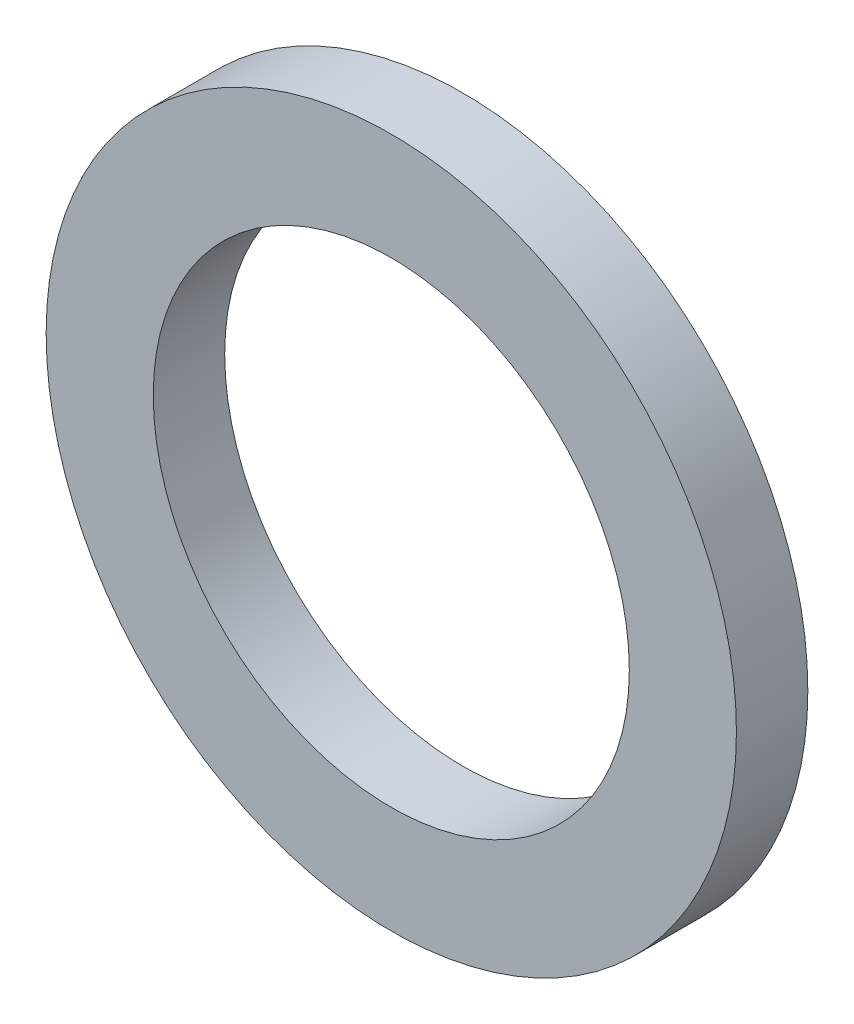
from build123d import *

# Parameters (mm, degrees)
ESQUISSE1_R          = 7.25
ESQUISSE1_R_2        = 5
BASE_EXTRUSION_DEPTH = 1.5


with BuildPart() as part:
    # Esquisse1 → Base-Extrusion (new body)
    with BuildSketch(Plane.XY):
        Circle(ESQUISSE1_R)
        Circle(ESQUISSE1_R_2, mode=Mode.SUBTRACT)
    extrude(amount=BASE_EXTRUSION_DEPTH)


solid = part.part
